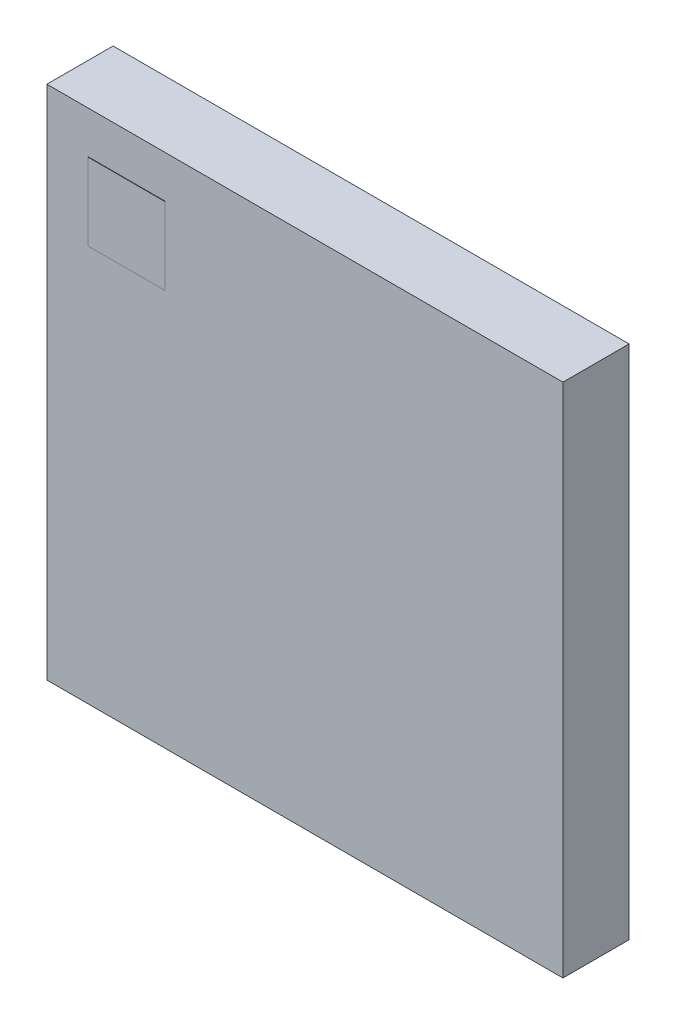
ISO-10303-21;
HEADER;
FILE_DESCRIPTION(('STEP AP214'),'2;1');
FILE_NAME('part.step','',(''),(''),'','','');
FILE_SCHEMA(('AUTOMOTIVE_DESIGN { 1 0 10303 214 1 1 1 1 }'));
ENDSEC;
DATA;
#1=APPLICATION_CONTEXT('core data for automotive mechanical design processes');
#2=APPLICATION_PROTOCOL_DEFINITION('international standard','automotive_design',2000,#1);
#3=PRODUCT_CONTEXT('',#1,'mechanical');
#4=PRODUCT('Part','Part','',(#3));
#5=PRODUCT_RELATED_PRODUCT_CATEGORY('part','',(#4));
#6=PRODUCT_DEFINITION_FORMATION('','',#4);
#7=PRODUCT_DEFINITION_CONTEXT('part definition',#1,'design');
#8=PRODUCT_DEFINITION('design','',#6,#7);
#9=PRODUCT_DEFINITION_SHAPE('','',#8);
#10=(LENGTH_UNIT() NAMED_UNIT(*) SI_UNIT(.MILLI.,.METRE.));
#11=(NAMED_UNIT(*) PLANE_ANGLE_UNIT() SI_UNIT($,.RADIAN.));
#12=(NAMED_UNIT(*) SI_UNIT($,.STERADIAN.) SOLID_ANGLE_UNIT());
#13=UNCERTAINTY_MEASURE_WITH_UNIT(LENGTH_MEASURE(1.E-05),#10,'distance_accuracy_value','');
#14=(GEOMETRIC_REPRESENTATION_CONTEXT(3) GLOBAL_UNCERTAINTY_ASSIGNED_CONTEXT((#13)) GLOBAL_UNIT_ASSIGNED_CONTEXT((#10,
#11,#12)) REPRESENTATION_CONTEXT('',''));
#15=CARTESIAN_POINT('',(0.,0.,0.));
#16=DIRECTION('',(0.,0.,1.));
#17=DIRECTION('',(1.,0.,0.));
#18=AXIS2_PLACEMENT_3D('',#15,#16,#17);
#19=CARTESIAN_POINT('',(-7.13240143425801,4.57451967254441,0.00254000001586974));
#20=DIRECTION('',(-1.,-1.19248806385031E-08,0.));
#21=DIRECTION('',(-1.19248806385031E-08,1.,0.));
#22=AXIS2_PLACEMENT_3D('',#19,#20,#21);
#23=PLANE('',#22);
#24=DIRECTION('',(0.,0.,1.));
#25=VECTOR('',#24,1.);
#26=CARTESIAN_POINT('',(-7.13240143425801,4.57451967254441,0.00254000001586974));
#27=LINE('',#26,#25);
#28=CARTESIAN_POINT('',(-7.13240143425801,4.57451967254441,0.00254000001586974));
#29=VERTEX_POINT('',#28);
#30=CARTESIAN_POINT('',(-7.13240143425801,4.57451967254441,2.19254070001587));
#31=VERTEX_POINT('',#30);
#32=EDGE_CURVE('P0_E11',#29,#31,#27,.T.);
#33=ORIENTED_EDGE('',*,*,#32,.T.);
#34=DIRECTION('',(-1.19248806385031E-08,1.,0.));
#35=VECTOR('',#34,1.);
#36=CARTESIAN_POINT('',(-7.13240143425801,4.57451967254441,2.19254070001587));
#37=LINE('',#36,#35);
#38=CARTESIAN_POINT('',(-7.13240146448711,7.10948031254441,2.19254070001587));
#39=VERTEX_POINT('',#38);
#40=EDGE_CURVE('P0_E24',#31,#39,#37,.T.);
#41=ORIENTED_EDGE('',*,*,#40,.T.);
#42=DIRECTION('',(0.,0.,1.));
#43=VECTOR('',#42,1.);
#44=CARTESIAN_POINT('',(-7.13240146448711,7.10948031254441,0.00254000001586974));
#45=LINE('',#44,#43);
#46=CARTESIAN_POINT('',(-7.13240146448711,7.10948031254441,0.00254000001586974));
#47=VERTEX_POINT('',#46);
#48=EDGE_CURVE('P0_E84',#47,#39,#45,.T.);
#49=ORIENTED_EDGE('',*,*,#48,.F.);
#50=DIRECTION('',(-1.19248806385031E-08,1.,0.));
#51=VECTOR('',#50,1.);
#52=CARTESIAN_POINT('',(-7.13240143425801,4.57451967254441,0.00254000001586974));
#53=LINE('',#52,#51);
#54=EDGE_CURVE('P0_E82',#29,#47,#53,.T.);
#55=ORIENTED_EDGE('',*,*,#54,.F.);
#56=EDGE_LOOP('',(#33,#41,#49,#55));
#57=FACE_BOUND('',#56,.T.);
#58=ADVANCED_FACE('P0_F17',(#57),#23,.T.);
#59=CARTESIAN_POINT('',(-7.13240146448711,7.10948031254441,0.00254000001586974));
#60=DIRECTION('',(-1.19248806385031E-08,1.,0.));
#61=DIRECTION('',(1.,1.19248806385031E-08,0.));
#62=AXIS2_PLACEMENT_3D('',#59,#60,#61);
#63=PLANE('',#62);
#64=ORIENTED_EDGE('',*,*,#48,.T.);
#65=DIRECTION('',(1.,1.19248806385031E-08,0.));
#66=VECTOR('',#65,1.);
#67=CARTESIAN_POINT('',(-7.13240146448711,7.10948031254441,2.19254070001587));
#68=LINE('',#67,#66);
#69=CARTESIAN_POINT('',(-4.60239890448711,7.10948034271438,2.19254070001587));
#70=VERTEX_POINT('',#69);
#71=EDGE_CURVE('P0_E79',#39,#70,#68,.T.);
#72=ORIENTED_EDGE('',*,*,#71,.T.);
#73=DIRECTION('',(0.,0.,1.));
#74=VECTOR('',#73,1.);
#75=CARTESIAN_POINT('',(-4.60239890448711,7.10948034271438,0.00254000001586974));
#76=LINE('',#75,#74);
#77=CARTESIAN_POINT('',(-4.60239890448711,7.10948034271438,0.00254000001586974));
#78=VERTEX_POINT('',#77);
#79=EDGE_CURVE('P0_E77',#78,#70,#76,.T.);
#80=ORIENTED_EDGE('',*,*,#79,.F.);
#81=DIRECTION('',(1.,1.19248806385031E-08,0.));
#82=VECTOR('',#81,1.);
#83=CARTESIAN_POINT('',(-7.13240146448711,7.10948031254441,0.00254000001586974));
#84=LINE('',#83,#82);
#85=EDGE_CURVE('P0_E67',#47,#78,#84,.T.);
#86=ORIENTED_EDGE('',*,*,#85,.F.);
#87=EDGE_LOOP('',(#64,#72,#80,#86));
#88=FACE_BOUND('',#87,.T.);
#89=ADVANCED_FACE('P0_F90',(#88),#63,.T.);
#90=CARTESIAN_POINT('',(-4.60239890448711,7.10948034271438,0.00254000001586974));
#91=DIRECTION('',(1.,1.19248806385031E-08,0.));
#92=DIRECTION('',(1.19248806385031E-08,-1.,0.));
#93=AXIS2_PLACEMENT_3D('',#90,#91,#92);
#94=PLANE('',#93);
#95=ORIENTED_EDGE('',*,*,#79,.T.);
#96=DIRECTION('',(1.19248806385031E-08,-1.,0.));
#97=VECTOR('',#96,1.);
#98=CARTESIAN_POINT('',(-4.60239890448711,7.10948034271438,2.19254070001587));
#99=LINE('',#98,#97);
#100=CARTESIAN_POINT('',(-4.60239887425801,4.57451970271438,2.19254070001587));
#101=VERTEX_POINT('',#100);
#102=EDGE_CURVE('P0_E59',#70,#101,#99,.T.);
#103=ORIENTED_EDGE('',*,*,#102,.T.);
#104=DIRECTION('',(0.,0.,1.));
#105=VECTOR('',#104,1.);
#106=CARTESIAN_POINT('',(-4.60239887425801,4.57451970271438,0.00254000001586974));
#107=LINE('',#106,#105);
#108=CARTESIAN_POINT('',(-4.60239887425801,4.57451970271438,0.00254000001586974));
#109=VERTEX_POINT('',#108);
#110=EDGE_CURVE('P0_E54',#109,#101,#107,.T.);
#111=ORIENTED_EDGE('',*,*,#110,.F.);
#112=DIRECTION('',(1.19248806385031E-08,-1.,0.));
#113=VECTOR('',#112,1.);
#114=CARTESIAN_POINT('',(-4.60239890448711,7.10948034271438,0.00254000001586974));
#115=LINE('',#114,#113);
#116=EDGE_CURVE('P0_E58',#78,#109,#115,.T.);
#117=ORIENTED_EDGE('',*,*,#116,.F.);
#118=EDGE_LOOP('',(#95,#103,#111,#117));
#119=FACE_BOUND('',#118,.T.);
#120=ADVANCED_FACE('P0_F57',(#119),#94,.T.);
#121=CARTESIAN_POINT('',(-4.60239887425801,4.57451970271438,0.00254000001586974));
#122=DIRECTION('',(1.19248806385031E-08,-1.,0.));
#123=DIRECTION('',(-1.,-1.19248806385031E-08,0.));
#124=AXIS2_PLACEMENT_3D('',#121,#122,#123);
#125=PLANE('',#124);
#126=ORIENTED_EDGE('',*,*,#110,.T.);
#127=DIRECTION('',(-1.,-1.19248806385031E-08,0.));
#128=VECTOR('',#127,1.);
#129=CARTESIAN_POINT('',(-4.60239887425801,4.57451970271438,2.19254070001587));
#130=LINE('',#129,#128);
#131=EDGE_CURVE('P0_E69',#101,#31,#130,.T.);
#132=ORIENTED_EDGE('',*,*,#131,.T.);
#133=ORIENTED_EDGE('',*,*,#32,.F.);
#134=DIRECTION('',(-1.,-1.19248806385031E-08,0.));
#135=VECTOR('',#134,1.);
#136=CARTESIAN_POINT('',(-4.60239887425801,4.57451970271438,0.00254000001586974));
#137=LINE('',#136,#135);
#138=EDGE_CURVE('P0_E66',#109,#29,#137,.T.);
#139=ORIENTED_EDGE('',*,*,#138,.F.);
#140=EDGE_LOOP('',(#126,#132,#133,#139));
#141=FACE_BOUND('',#140,.T.);
#142=ADVANCED_FACE('P0_F71',(#141),#125,.T.);
#143=CARTESIAN_POINT('',(-7.13240143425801,4.57451967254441,0.00254000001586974));
#144=DIRECTION('',(0.,0.,1.));
#145=DIRECTION('',(1.19248806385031E-08,-1.,0.));
#146=AXIS2_PLACEMENT_3D('',#143,#144,#145);
#147=PLANE('',#146);
#148=ORIENTED_EDGE('',*,*,#54,.T.);
#149=ORIENTED_EDGE('',*,*,#85,.T.);
#150=ORIENTED_EDGE('',*,*,#116,.T.);
#151=ORIENTED_EDGE('',*,*,#138,.T.);
#152=EDGE_LOOP('',(#148,#149,#150,#151));
#153=FACE_BOUND('',#152,.T.);
#154=ADVANCED_FACE('P0_F65',(#153),#147,.F.);
#155=CARTESIAN_POINT('',(-7.13240143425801,4.57451967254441,2.19254070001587));
#156=DIRECTION('',(0.,0.,1.));
#157=DIRECTION('',(1.19248806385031E-08,-1.,0.));
#158=AXIS2_PLACEMENT_3D('',#155,#156,#157);
#159=PLANE('',#158);
#160=ORIENTED_EDGE('',*,*,#131,.F.);
#161=ORIENTED_EDGE('',*,*,#102,.F.);
#162=ORIENTED_EDGE('',*,*,#71,.F.);
#163=ORIENTED_EDGE('',*,*,#40,.F.);
#164=EDGE_LOOP('',(#160,#161,#162,#163));
#165=FACE_BOUND('',#164,.T.);
#166=ADVANCED_FACE('P0_F91',(#165),#159,.T.);
#167=CLOSED_SHELL('',(#58,#89,#120,#142,#154,#166));
#168=MANIFOLD_SOLID_BREP('P0_B1',#167);
#169=CARTESIAN_POINT('',(-8.50000067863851,-8.5000008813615,0.));
#170=DIRECTION('',(-1.,-1.19248806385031E-08,0.));
#171=DIRECTION('',(-1.19248806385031E-08,1.,0.));
#172=AXIS2_PLACEMENT_3D('',#169,#170,#171);
#173=PLANE('',#172);
#174=DIRECTION('',(0.,0.,1.));
#175=VECTOR('',#174,1.);
#176=CARTESIAN_POINT('',(-8.50000067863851,-8.5000008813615,0.));
#177=LINE('',#176,#175);
#178=CARTESIAN_POINT('',(-8.50000067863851,-8.5000008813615,0.));
#179=VERTEX_POINT('',#178);
#180=CARTESIAN_POINT('',(-8.50000067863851,-8.5000008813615,2.18000072));
#181=VERTEX_POINT('',#180);
#182=EDGE_CURVE('P1_E11',#179,#181,#177,.T.);
#183=ORIENTED_EDGE('',*,*,#182,.T.);
#184=DIRECTION('',(-1.19248806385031E-08,1.,0.));
#185=VECTOR('',#184,1.);
#186=CARTESIAN_POINT('',(-8.50000067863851,-8.5000008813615,2.18000072));
#187=LINE('',#186,#185);
#188=CARTESIAN_POINT('',(-8.5000008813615,8.50000067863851,2.18000072));
#189=VERTEX_POINT('',#188);
#190=EDGE_CURVE('P1_E24',#181,#189,#187,.T.);
#191=ORIENTED_EDGE('',*,*,#190,.T.);
#192=DIRECTION('',(0.,0.,1.));
#193=VECTOR('',#192,1.);
#194=CARTESIAN_POINT('',(-8.5000008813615,8.50000067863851,0.));
#195=LINE('',#194,#193);
#196=CARTESIAN_POINT('',(-8.5000008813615,8.50000067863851,0.));
#197=VERTEX_POINT('',#196);
#198=EDGE_CURVE('P1_E85',#197,#189,#195,.T.);
#199=ORIENTED_EDGE('',*,*,#198,.F.);
#200=DIRECTION('',(-1.19248806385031E-08,1.,0.));
#201=VECTOR('',#200,1.);
#202=CARTESIAN_POINT('',(-8.50000067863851,-8.5000008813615,0.));
#203=LINE('',#202,#201);
#204=EDGE_CURVE('P1_E83',#179,#197,#203,.T.);
#205=ORIENTED_EDGE('',*,*,#204,.F.);
#206=EDGE_LOOP('',(#183,#191,#199,#205));
#207=FACE_BOUND('',#206,.T.);
#208=ADVANCED_FACE('P1_F17',(#207),#173,.T.);
#209=CARTESIAN_POINT('',(-8.5000008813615,8.50000067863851,0.));
#210=DIRECTION('',(-1.19248806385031E-08,1.,0.));
#211=DIRECTION('',(1.,1.19248806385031E-08,0.));
#212=AXIS2_PLACEMENT_3D('',#209,#210,#211);
#213=PLANE('',#212);
#214=ORIENTED_EDGE('',*,*,#198,.T.);
#215=DIRECTION('',(1.,1.19248806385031E-08,0.));
#216=VECTOR('',#215,1.);
#217=CARTESIAN_POINT('',(-8.5000008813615,8.50000067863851,2.18000072));
#218=LINE('',#217,#216);
#219=CARTESIAN_POINT('',(8.50000067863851,8.5000008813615,2.18000072));
#220=VERTEX_POINT('',#219);
#221=EDGE_CURVE('P1_E81',#189,#220,#218,.T.);
#222=ORIENTED_EDGE('',*,*,#221,.T.);
#223=DIRECTION('',(0.,0.,1.));
#224=VECTOR('',#223,1.);
#225=CARTESIAN_POINT('',(8.50000067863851,8.5000008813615,0.));
#226=LINE('',#225,#224);
#227=CARTESIAN_POINT('',(8.50000067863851,8.5000008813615,0.));
#228=VERTEX_POINT('',#227);
#229=EDGE_CURVE('P1_E79',#228,#220,#226,.T.);
#230=ORIENTED_EDGE('',*,*,#229,.F.);
#231=DIRECTION('',(1.,1.19248806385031E-08,0.));
#232=VECTOR('',#231,1.);
#233=CARTESIAN_POINT('',(-8.5000008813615,8.50000067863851,0.));
#234=LINE('',#233,#232);
#235=EDGE_CURVE('P1_E60',#197,#228,#234,.T.);
#236=ORIENTED_EDGE('',*,*,#235,.F.);
#237=EDGE_LOOP('',(#214,#222,#230,#236));
#238=FACE_BOUND('',#237,.T.);
#239=ADVANCED_FACE('P1_F90',(#238),#213,.T.);
#240=CARTESIAN_POINT('',(8.50000067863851,8.5000008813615,0.));
#241=DIRECTION('',(1.,1.19248806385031E-08,0.));
#242=DIRECTION('',(1.19248806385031E-08,-1.,0.));
#243=AXIS2_PLACEMENT_3D('',#240,#241,#242);
#244=PLANE('',#243);
#245=ORIENTED_EDGE('',*,*,#229,.T.);
#246=DIRECTION('',(1.19248806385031E-08,-1.,0.));
#247=VECTOR('',#246,1.);
#248=CARTESIAN_POINT('',(8.50000067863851,8.5000008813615,2.18000072));
#249=LINE('',#248,#247);
#250=CARTESIAN_POINT('',(8.5000008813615,-8.50000067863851,2.18000072));
#251=VERTEX_POINT('',#250);
#252=EDGE_CURVE('P1_E70',#220,#251,#249,.T.);
#253=ORIENTED_EDGE('',*,*,#252,.T.);
#254=DIRECTION('',(0.,0.,1.));
#255=VECTOR('',#254,1.);
#256=CARTESIAN_POINT('',(8.5000008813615,-8.50000067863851,0.));
#257=LINE('',#256,#255);
#258=CARTESIAN_POINT('',(8.5000008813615,-8.50000067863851,0.));
#259=VERTEX_POINT('',#258);
#260=EDGE_CURVE('P1_E64',#259,#251,#257,.T.);
#261=ORIENTED_EDGE('',*,*,#260,.F.);
#262=DIRECTION('',(1.19248806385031E-08,-1.,0.));
#263=VECTOR('',#262,1.);
#264=CARTESIAN_POINT('',(8.50000067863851,8.5000008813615,0.));
#265=LINE('',#264,#263);
#266=EDGE_CURVE('P1_E54',#228,#259,#265,.T.);
#267=ORIENTED_EDGE('',*,*,#266,.F.);
#268=EDGE_LOOP('',(#245,#253,#261,#267));
#269=FACE_BOUND('',#268,.T.);
#270=ADVANCED_FACE('P1_F68',(#269),#244,.T.);
#271=CARTESIAN_POINT('',(8.5000008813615,-8.50000067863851,0.));
#272=DIRECTION('',(1.19248806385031E-08,-1.,0.));
#273=DIRECTION('',(-1.,-1.19248806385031E-08,0.));
#274=AXIS2_PLACEMENT_3D('',#271,#272,#273);
#275=PLANE('',#274);
#276=ORIENTED_EDGE('',*,*,#260,.T.);
#277=DIRECTION('',(-1.,-1.19248806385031E-08,0.));
#278=VECTOR('',#277,1.);
#279=CARTESIAN_POINT('',(8.5000008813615,-8.50000067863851,2.18000072));
#280=LINE('',#279,#278);
#281=EDGE_CURVE('P1_E65',#251,#181,#280,.T.);
#282=ORIENTED_EDGE('',*,*,#281,.T.);
#283=ORIENTED_EDGE('',*,*,#182,.F.);
#284=DIRECTION('',(-1.,-1.19248806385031E-08,0.));
#285=VECTOR('',#284,1.);
#286=CARTESIAN_POINT('',(8.5000008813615,-8.50000067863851,0.));
#287=LINE('',#286,#285);
#288=EDGE_CURVE('P1_E58',#259,#179,#287,.T.);
#289=ORIENTED_EDGE('',*,*,#288,.F.);
#290=EDGE_LOOP('',(#276,#282,#283,#289));
#291=FACE_BOUND('',#290,.T.);
#292=ADVANCED_FACE('P1_F73',(#291),#275,.T.);
#293=CARTESIAN_POINT('',(-8.50000067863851,-8.5000008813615,0.));
#294=DIRECTION('',(0.,0.,1.));
#295=DIRECTION('',(1.19248806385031E-08,-1.,0.));
#296=AXIS2_PLACEMENT_3D('',#293,#294,#295);
#297=PLANE('',#296);
#298=ORIENTED_EDGE('',*,*,#204,.T.);
#299=ORIENTED_EDGE('',*,*,#235,.T.);
#300=ORIENTED_EDGE('',*,*,#266,.T.);
#301=ORIENTED_EDGE('',*,*,#288,.T.);
#302=EDGE_LOOP('',(#298,#299,#300,#301));
#303=FACE_BOUND('',#302,.T.);
#304=ADVANCED_FACE('P1_F57',(#303),#297,.F.);
#305=CARTESIAN_POINT('',(-8.50000067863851,-8.5000008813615,2.18000072));
#306=DIRECTION('',(0.,0.,1.));
#307=DIRECTION('',(1.19248806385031E-08,-1.,0.));
#308=AXIS2_PLACEMENT_3D('',#305,#306,#307);
#309=PLANE('',#308);
#310=ORIENTED_EDGE('',*,*,#281,.F.);
#311=ORIENTED_EDGE('',*,*,#252,.F.);
#312=ORIENTED_EDGE('',*,*,#221,.F.);
#313=ORIENTED_EDGE('',*,*,#190,.F.);
#314=EDGE_LOOP('',(#310,#311,#312,#313));
#315=FACE_BOUND('',#314,.T.);
#316=ADVANCED_FACE('P1_F91',(#315),#309,.T.);
#317=CLOSED_SHELL('',(#208,#239,#270,#292,#304,#316));
#318=MANIFOLD_SOLID_BREP('P1_B1',#317);
#319=ADVANCED_BREP_SHAPE_REPRESENTATION('',(#18,#168,#318),#14);
#320=SHAPE_DEFINITION_REPRESENTATION(#9,#319);
ENDSEC;
END-ISO-10303-21;
